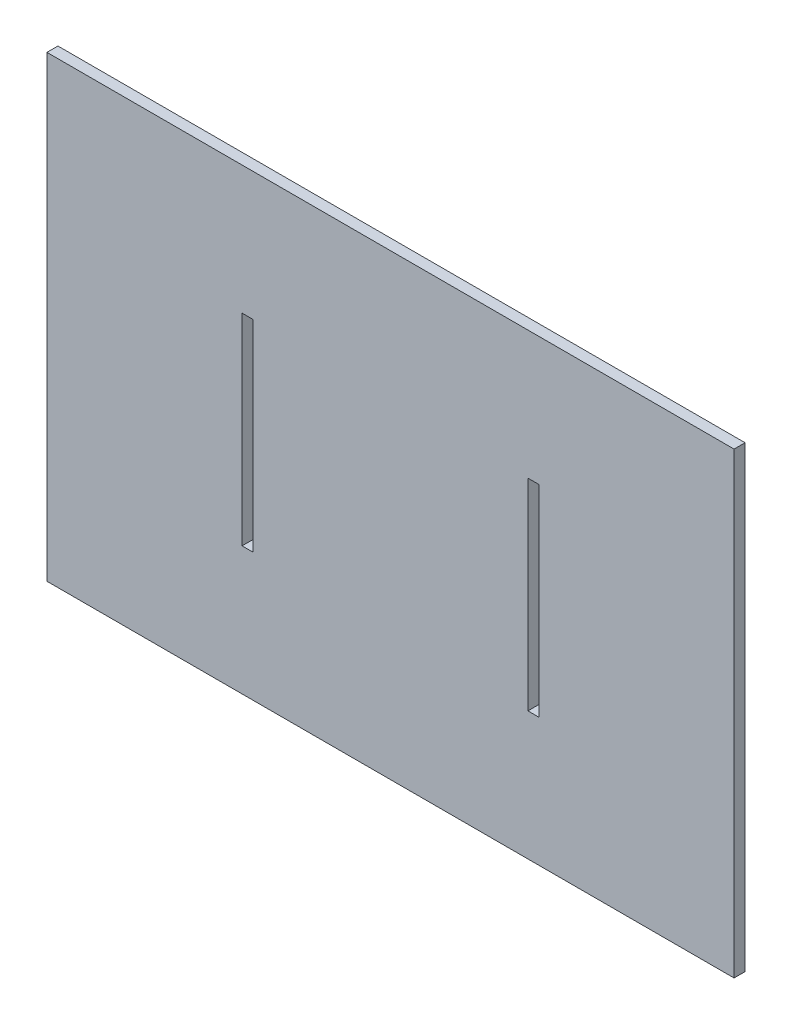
from build123d import *

# Parameters (mm, degrees)
SKETCH1_W           = 750
SKETCH1_H           = 500
BOSS_EXTRUDE1_DEPTH = 12
SKETCH2_W           = 12
SKETCH2_H           = 220
CUT_EXTRUDE1_DEPTH  = 14


with BuildPart() as part:
    # Sketch1 → Boss-Extrude1 (new body)
    with BuildSketch(Plane.XY):
        with Locations((375, 250)):
            Rectangle(SKETCH1_W, SKETCH1_H)
    extrude(amount=BOSS_EXTRUDE1_DEPTH)

    # Sketch2 → Cut-Extrude1 (cut)
    with BuildSketch(Plane.XY.offset(12)):
        with Locations((219, 250)):
            Rectangle(SKETCH2_W, SKETCH2_H)
        with Locations((531, 250)):
            Rectangle(SKETCH2_W, SKETCH2_H)
    extrude(amount=-CUT_EXTRUDE1_DEPTH, mode=Mode.SUBTRACT)


solid = part.part
